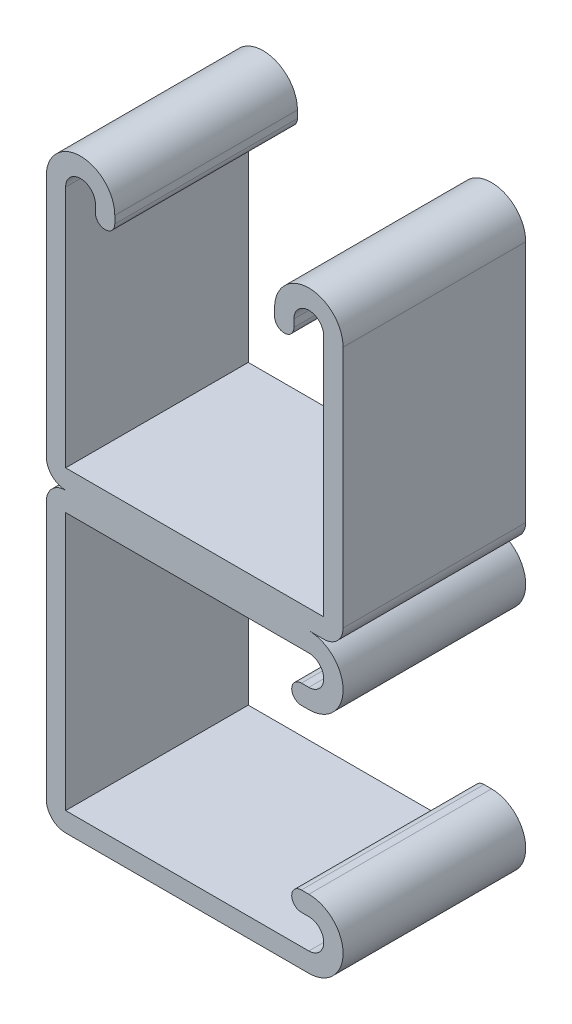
from build123d import *

# Parameters (mm, degrees)
BASE_EXTRUDE_DEPTH = 12.7
CIRPATTERN1_COUNT  = 2
CIRPATTERN1_ANGLE  = 270


with BuildPart() as part:
    # Sketch1 → Base-Extrude (new, symmetric)
    with BuildSketch(Plane.XY):
        with BuildLine():
            Line((0, 36.5125), (0, 2.6924))
            ThreePointArc((0, 2.6924), (0.788585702, 0.788585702), (2.6924, 0))
            Line((2.6924, 0), (38.5826, 0))
            ThreePointArc((38.5826, 0), (40.486414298, 0.788585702), (41.275, 2.6924))
            Line((41.275, 2.6924), (41.275, 36.5125))
            ThreePointArc((41.275, 36.5125), (36.5125, 41.275), (31.75, 36.5125))
            Line((31.75, 36.5125), (31.75, 35.47745))
            ThreePointArc((31.75, 35.47745), (33.0962, 34.13125), (34.4424, 35.47745))
            Line((34.4424, 35.47745), (34.4424, 36.5125))
            ThreePointArc((34.4424, 36.5125), (36.5125, 38.5826), (38.5826, 36.5125))
            Line((38.5826, 36.5125), (38.5826, 2.6924))
            Line((38.5826, 2.6924), (2.6924, 2.6924))
            Line((2.6924, 2.6924), (2.6924, 36.5125))
            ThreePointArc((2.6924, 36.5125), (4.7625, 38.5826), (6.8326, 36.5125))
            Line((6.8326, 36.5125), (6.8326, 35.47745))
            ThreePointArc((6.8326, 35.47745), (8.1788, 34.13125), (9.525, 35.47745))
            Line((9.525, 35.47745), (9.525, 36.5125))
            ThreePointArc((9.525, 36.5125), (4.7625, 41.275), (0, 36.5125))
        make_face()
    base_extrude = extrude(amount=BASE_EXTRUDE_DEPTH, both=True)

    # CirPattern1: Base-Extrude ×2 about axis
    cirpattern1_axis = Axis((0, 0, 0), (0, 0, 1))
    for i in range(1, CIRPATTERN1_COUNT):
        add(base_extrude.rotate(cirpattern1_axis, i * CIRPATTERN1_ANGLE / (CIRPATTERN1_COUNT - 1)))


solid = part.part
